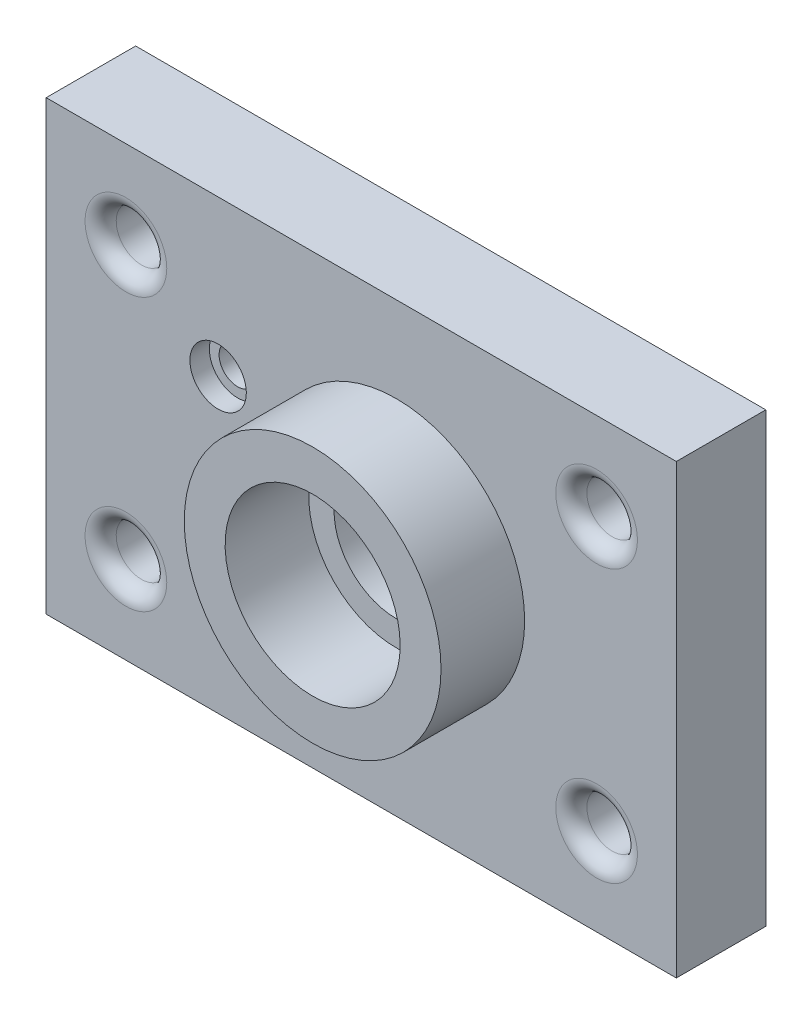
ISO-10303-21;
HEADER;
FILE_DESCRIPTION(('STEP AP214'),'2;1');
FILE_NAME('part.step','',(''),(''),'','','');
FILE_SCHEMA(('AUTOMOTIVE_DESIGN { 1 0 10303 214 1 1 1 1 }'));
ENDSEC;
DATA;
#1=APPLICATION_CONTEXT('core data for automotive mechanical design processes');
#2=APPLICATION_PROTOCOL_DEFINITION('international standard','automotive_design',2000,#1);
#3=PRODUCT_CONTEXT('',#1,'mechanical');
#4=PRODUCT('Part','Part','',(#3));
#5=PRODUCT_RELATED_PRODUCT_CATEGORY('part','',(#4));
#6=PRODUCT_DEFINITION_FORMATION('','',#4);
#7=PRODUCT_DEFINITION_CONTEXT('part definition',#1,'design');
#8=PRODUCT_DEFINITION('design','',#6,#7);
#9=PRODUCT_DEFINITION_SHAPE('','',#8);
#10=(LENGTH_UNIT() NAMED_UNIT(*) SI_UNIT(.MILLI.,.METRE.));
#11=(NAMED_UNIT(*) PLANE_ANGLE_UNIT() SI_UNIT($,.RADIAN.));
#12=(NAMED_UNIT(*) SI_UNIT($,.STERADIAN.) SOLID_ANGLE_UNIT());
#13=UNCERTAINTY_MEASURE_WITH_UNIT(LENGTH_MEASURE(1.E-05),#10,'distance_accuracy_value','');
#14=(GEOMETRIC_REPRESENTATION_CONTEXT(3) GLOBAL_UNCERTAINTY_ASSIGNED_CONTEXT((#13)) GLOBAL_UNIT_ASSIGNED_CONTEXT((#10,
#11,#12)) REPRESENTATION_CONTEXT('',''));
#15=CARTESIAN_POINT('',(0.,0.,0.));
#16=DIRECTION('',(0.,0.,1.));
#17=DIRECTION('',(1.,0.,0.));
#18=AXIS2_PLACEMENT_3D('',#15,#16,#17);
#19=CARTESIAN_POINT('',(44.2,-40.,0.));
#20=DIRECTION('',(0.,0.,1.));
#21=DIRECTION('',(0.,-1.,0.));
#22=AXIS2_PLACEMENT_3D('',#19,#20,#21);
#23=CYLINDRICAL_SURFACE('',#22,4.75);
#24=CARTESIAN_POINT('',(44.2,-40.,0.));
#25=DIRECTION('',(0.,0.,1.));
#26=DIRECTION('',(0.,-1.,0.));
#27=AXIS2_PLACEMENT_3D('',#24,#25,#26);
#28=CIRCLE('',#27,4.75);
#29=CARTESIAN_POINT('',(44.2,-44.75,0.));
#30=VERTEX_POINT('',#29);
#31=EDGE_CURVE('E229',#30,#30,#28,.T.);
#32=ORIENTED_EDGE('',*,*,#31,.F.);
#33=EDGE_LOOP('',(#32));
#34=FACE_BOUND('',#33,.T.);
#35=CARTESIAN_POINT('',(44.2,-40.,18.));
#36=DIRECTION('',(0.,0.,1.));
#37=DIRECTION('',(0.,-1.,0.));
#38=AXIS2_PLACEMENT_3D('',#35,#36,#37);
#39=CIRCLE('',#38,4.75);
#40=CARTESIAN_POINT('',(44.2,-44.75,18.));
#41=VERTEX_POINT('',#40);
#42=EDGE_CURVE('E50',#41,#41,#39,.F.);
#43=ORIENTED_EDGE('',*,*,#42,.F.);
#44=EDGE_LOOP('',(#43));
#45=FACE_BOUND('',#44,.T.);
#46=ADVANCED_FACE('F46',(#34,#45),#23,.F.);
#47=CARTESIAN_POINT('',(0.,0.,23.));
#48=DIRECTION('',(-1.,0.,0.));
#49=DIRECTION('',(0.,0.,1.));
#50=AXIS2_PLACEMENT_3D('',#47,#48,#49);
#51=PLANE('',#50);
#52=DIRECTION('',(0.,1.,0.));
#53=VECTOR('',#52,1.);
#54=CARTESIAN_POINT('',(0.,0.,0.));
#55=LINE('',#54,#53);
#56=CARTESIAN_POINT('',(0.,-115.,0.));
#57=VERTEX_POINT('',#56);
#58=CARTESIAN_POINT('',(0.,0.,0.));
#59=VERTEX_POINT('',#58);
#60=EDGE_CURVE('E116',#57,#59,#55,.T.);
#61=ORIENTED_EDGE('',*,*,#60,.F.);
#62=DIRECTION('',(0.,0.,-1.));
#63=VECTOR('',#62,1.);
#64=CARTESIAN_POINT('',(0.,-115.,23.));
#65=LINE('',#64,#63);
#66=CARTESIAN_POINT('',(0.,-115.,23.));
#67=VERTEX_POINT('',#66);
#68=EDGE_CURVE('E64',#67,#57,#65,.T.);
#69=ORIENTED_EDGE('',*,*,#68,.F.);
#70=DIRECTION('',(0.,1.,0.));
#71=VECTOR('',#70,1.);
#72=CARTESIAN_POINT('',(0.,0.,23.));
#73=LINE('',#72,#71);
#74=CARTESIAN_POINT('',(0.,0.,23.));
#75=VERTEX_POINT('',#74);
#76=EDGE_CURVE('E109',#67,#75,#73,.T.);
#77=ORIENTED_EDGE('',*,*,#76,.T.);
#78=DIRECTION('',(0.,0.,-1.));
#79=VECTOR('',#78,1.);
#80=CARTESIAN_POINT('',(0.,0.,23.));
#81=LINE('',#80,#79);
#82=EDGE_CURVE('E92',#75,#59,#81,.T.);
#83=ORIENTED_EDGE('',*,*,#82,.T.);
#84=EDGE_LOOP('',(#61,#69,#77,#83));
#85=FACE_BOUND('',#84,.T.);
#86=ADVANCED_FACE('F170',(#85),#51,.T.);
#87=CARTESIAN_POINT('',(0.,-115.,23.));
#88=DIRECTION('',(0.,-1.,0.));
#89=DIRECTION('',(0.,0.,-1.));
#90=AXIS2_PLACEMENT_3D('',#87,#88,#89);
#91=PLANE('',#90);
#92=DIRECTION('',(-1.,0.,0.));
#93=VECTOR('',#92,1.);
#94=CARTESIAN_POINT('',(0.,-115.,0.));
#95=LINE('',#94,#93);
#96=CARTESIAN_POINT('',(162.,-115.,0.));
#97=VERTEX_POINT('',#96);
#98=EDGE_CURVE('E111',#97,#57,#95,.T.);
#99=ORIENTED_EDGE('',*,*,#98,.F.);
#100=DIRECTION('',(0.,0.,-1.));
#101=VECTOR('',#100,1.);
#102=CARTESIAN_POINT('',(162.,-115.,23.));
#103=LINE('',#102,#101);
#104=CARTESIAN_POINT('',(162.,-115.,23.));
#105=VERTEX_POINT('',#104);
#106=EDGE_CURVE('E81',#105,#97,#103,.T.);
#107=ORIENTED_EDGE('',*,*,#106,.F.);
#108=DIRECTION('',(-1.,0.,0.));
#109=VECTOR('',#108,1.);
#110=CARTESIAN_POINT('',(0.,-115.,23.));
#111=LINE('',#110,#109);
#112=EDGE_CURVE('E106',#105,#67,#111,.T.);
#113=ORIENTED_EDGE('',*,*,#112,.T.);
#114=ORIENTED_EDGE('',*,*,#68,.T.);
#115=EDGE_LOOP('',(#99,#107,#113,#114));
#116=FACE_BOUND('',#115,.T.);
#117=ADVANCED_FACE('F176',(#116),#91,.T.);
#118=CARTESIAN_POINT('',(162.,0.,23.));
#119=DIRECTION('',(1.,0.,0.));
#120=DIRECTION('',(0.,0.,-1.));
#121=AXIS2_PLACEMENT_3D('',#118,#119,#120);
#122=PLANE('',#121);
#123=DIRECTION('',(0.,-1.,0.));
#124=VECTOR('',#123,1.);
#125=CARTESIAN_POINT('',(162.,0.,0.));
#126=LINE('',#125,#124);
#127=CARTESIAN_POINT('',(162.,0.,0.));
#128=VERTEX_POINT('',#127);
#129=EDGE_CURVE('E100',#128,#97,#126,.T.);
#130=ORIENTED_EDGE('',*,*,#129,.F.);
#131=DIRECTION('',(0.,0.,-1.));
#132=VECTOR('',#131,1.);
#133=CARTESIAN_POINT('',(162.,0.,23.));
#134=LINE('',#133,#132);
#135=CARTESIAN_POINT('',(162.,0.,23.));
#136=VERTEX_POINT('',#135);
#137=EDGE_CURVE('E95',#136,#128,#134,.T.);
#138=ORIENTED_EDGE('',*,*,#137,.F.);
#139=DIRECTION('',(0.,-1.,0.));
#140=VECTOR('',#139,1.);
#141=CARTESIAN_POINT('',(162.,0.,23.));
#142=LINE('',#141,#140);
#143=EDGE_CURVE('E98',#136,#105,#142,.T.);
#144=ORIENTED_EDGE('',*,*,#143,.T.);
#145=ORIENTED_EDGE('',*,*,#106,.T.);
#146=EDGE_LOOP('',(#130,#138,#144,#145));
#147=FACE_BOUND('',#146,.T.);
#148=ADVANCED_FACE('F97',(#147),#122,.T.);
#149=CARTESIAN_POINT('',(0.,0.,23.));
#150=DIRECTION('',(0.,1.,0.));
#151=DIRECTION('',(0.,0.,1.));
#152=AXIS2_PLACEMENT_3D('',#149,#150,#151);
#153=PLANE('',#152);
#154=DIRECTION('',(1.,0.,0.));
#155=VECTOR('',#154,1.);
#156=CARTESIAN_POINT('',(0.,0.,0.));
#157=LINE('',#156,#155);
#158=EDGE_CURVE('E119',#59,#128,#157,.T.);
#159=ORIENTED_EDGE('',*,*,#158,.F.);
#160=ORIENTED_EDGE('',*,*,#82,.F.);
#161=DIRECTION('',(1.,0.,0.));
#162=VECTOR('',#161,1.);
#163=CARTESIAN_POINT('',(0.,0.,23.));
#164=LINE('',#163,#162);
#165=EDGE_CURVE('E105',#75,#136,#164,.T.);
#166=ORIENTED_EDGE('',*,*,#165,.T.);
#167=ORIENTED_EDGE('',*,*,#137,.T.);
#168=EDGE_LOOP('',(#159,#160,#166,#167));
#169=FACE_BOUND('',#168,.T.);
#170=ADVANCED_FACE('F108',(#169),#153,.T.);
#171=CARTESIAN_POINT('',(0.,0.,23.));
#172=DIRECTION('',(0.,0.,1.));
#173=DIRECTION('',(1.,0.,0.));
#174=AXIS2_PLACEMENT_3D('',#171,#172,#173);
#175=PLANE('',#174);
#176=CARTESIAN_POINT('',(44.2,-40.,23.));
#177=DIRECTION('',(0.,0.,1.));
#178=DIRECTION('',(0.,-1.,0.));
#179=AXIS2_PLACEMENT_3D('',#176,#177,#178);
#180=CIRCLE('',#179,7.25);
#181=CARTESIAN_POINT('',(44.2,-47.25,23.));
#182=VERTEX_POINT('',#181);
#183=EDGE_CURVE('E265',#182,#182,#180,.T.);
#184=ORIENTED_EDGE('',*,*,#183,.F.);
#185=EDGE_LOOP('',(#184));
#186=FACE_BOUND('',#185,.T.);
#187=CARTESIAN_POINT('',(141.5,-92.5,23.));
#188=DIRECTION('',(0.,0.,1.));
#189=DIRECTION('',(1.,0.,0.));
#190=AXIS2_PLACEMENT_3D('',#187,#188,#189);
#191=CIRCLE('',#190,10.5);
#192=CARTESIAN_POINT('',(152.,-92.5,23.));
#193=VERTEX_POINT('',#192);
#194=EDGE_CURVE('E146',#193,#193,#191,.F.);
#195=ORIENTED_EDGE('',*,*,#194,.T.);
#196=EDGE_LOOP('',(#195));
#197=FACE_BOUND('',#196,.T.);
#198=CARTESIAN_POINT('',(141.5,-22.5,23.));
#199=DIRECTION('',(0.,0.,1.));
#200=DIRECTION('',(1.,0.,0.));
#201=AXIS2_PLACEMENT_3D('',#198,#199,#200);
#202=CIRCLE('',#201,10.5);
#203=CARTESIAN_POINT('',(152.,-22.5,23.));
#204=VERTEX_POINT('',#203);
#205=EDGE_CURVE('E143',#204,#204,#202,.F.);
#206=ORIENTED_EDGE('',*,*,#205,.T.);
#207=EDGE_LOOP('',(#206));
#208=FACE_BOUND('',#207,.T.);
#209=CARTESIAN_POINT('',(20.5,-22.5,23.));
#210=DIRECTION('',(0.,0.,1.));
#211=DIRECTION('',(1.,0.,0.));
#212=AXIS2_PLACEMENT_3D('',#209,#210,#211);
#213=CIRCLE('',#212,10.5);
#214=CARTESIAN_POINT('',(31.,-22.5,23.));
#215=VERTEX_POINT('',#214);
#216=EDGE_CURVE('E140',#215,#215,#213,.F.);
#217=ORIENTED_EDGE('',*,*,#216,.T.);
#218=EDGE_LOOP('',(#217));
#219=FACE_BOUND('',#218,.T.);
#220=CARTESIAN_POINT('',(20.5,-92.5,23.));
#221=DIRECTION('',(0.,0.,1.));
#222=DIRECTION('',(1.,0.,0.));
#223=AXIS2_PLACEMENT_3D('',#220,#221,#222);
#224=CIRCLE('',#223,10.5);
#225=CARTESIAN_POINT('',(31.,-92.5,23.));
#226=VERTEX_POINT('',#225);
#227=EDGE_CURVE('E134',#226,#226,#224,.F.);
#228=ORIENTED_EDGE('',*,*,#227,.T.);
#229=EDGE_LOOP('',(#228));
#230=FACE_BOUND('',#229,.T.);
#231=CARTESIAN_POINT('',(90.,-55.,23.));
#232=DIRECTION('',(0.,0.,1.));
#233=DIRECTION('',(0.,-1.,0.));
#234=AXIS2_PLACEMENT_3D('',#231,#232,#233);
#235=CIRCLE('',#234,33.);
#236=CARTESIAN_POINT('',(90.,-88.,23.));
#237=VERTEX_POINT('',#236);
#238=EDGE_CURVE('E242',#237,#237,#235,.T.);
#239=ORIENTED_EDGE('',*,*,#238,.F.);
#240=EDGE_LOOP('',(#239));
#241=FACE_BOUND('',#240,.T.);
#242=ORIENTED_EDGE('',*,*,#76,.F.);
#243=ORIENTED_EDGE('',*,*,#112,.F.);
#244=ORIENTED_EDGE('',*,*,#143,.F.);
#245=ORIENTED_EDGE('',*,*,#165,.F.);
#246=EDGE_LOOP('',(#242,#243,#244,#245));
#247=FACE_BOUND('',#246,.T.);
#248=ADVANCED_FACE('F104',(#186,#197,#208,#219,#230,#241,#247),#175,.T.);
#249=CARTESIAN_POINT('',(0.,0.,0.));
#250=DIRECTION('',(0.,0.,1.));
#251=DIRECTION('',(1.,0.,0.));
#252=AXIS2_PLACEMENT_3D('',#249,#250,#251);
#253=PLANE('',#252);
#254=CARTESIAN_POINT('',(90.,-55.,0.));
#255=DIRECTION('',(0.,0.,1.));
#256=DIRECTION('',(0.,-1.,0.));
#257=AXIS2_PLACEMENT_3D('',#254,#255,#256);
#258=CIRCLE('',#257,16.);
#259=CARTESIAN_POINT('',(90.,-71.,0.));
#260=VERTEX_POINT('',#259);
#261=EDGE_CURVE('E262',#260,#260,#258,.T.);
#262=ORIENTED_EDGE('',*,*,#261,.T.);
#263=EDGE_LOOP('',(#262));
#264=FACE_BOUND('',#263,.T.);
#265=CARTESIAN_POINT('',(141.5,-92.5,0.));
#266=DIRECTION('',(0.,0.,1.));
#267=DIRECTION('',(0.,-1.,0.));
#268=AXIS2_PLACEMENT_3D('',#265,#266,#267);
#269=CIRCLE('',#268,6.50000000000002);
#270=CARTESIAN_POINT('',(141.5,-99.,0.));
#271=VERTEX_POINT('',#270);
#272=EDGE_CURVE('E273',#271,#271,#269,.T.);
#273=ORIENTED_EDGE('',*,*,#272,.T.);
#274=EDGE_LOOP('',(#273));
#275=FACE_BOUND('',#274,.T.);
#276=CARTESIAN_POINT('',(141.5,-22.5,0.));
#277=DIRECTION('',(0.,0.,1.));
#278=DIRECTION('',(0.,-1.,0.));
#279=AXIS2_PLACEMENT_3D('',#276,#277,#278);
#280=CIRCLE('',#279,6.50000000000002);
#281=CARTESIAN_POINT('',(141.5,-29.,0.));
#282=VERTEX_POINT('',#281);
#283=EDGE_CURVE('E236',#282,#282,#280,.T.);
#284=ORIENTED_EDGE('',*,*,#283,.T.);
#285=EDGE_LOOP('',(#284));
#286=FACE_BOUND('',#285,.T.);
#287=CARTESIAN_POINT('',(20.5,-22.5,0.));
#288=DIRECTION('',(0.,0.,1.));
#289=DIRECTION('',(0.,-1.,0.));
#290=AXIS2_PLACEMENT_3D('',#287,#288,#289);
#291=CIRCLE('',#290,6.50000000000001);
#292=CARTESIAN_POINT('',(20.5,-29.,0.));
#293=VERTEX_POINT('',#292);
#294=EDGE_CURVE('E230',#293,#293,#291,.T.);
#295=ORIENTED_EDGE('',*,*,#294,.T.);
#296=EDGE_LOOP('',(#295));
#297=FACE_BOUND('',#296,.T.);
#298=CARTESIAN_POINT('',(20.5,-92.5,0.));
#299=DIRECTION('',(0.,0.,1.));
#300=DIRECTION('',(0.,-1.,0.));
#301=AXIS2_PLACEMENT_3D('',#298,#299,#300);
#302=CIRCLE('',#301,6.50000000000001);
#303=CARTESIAN_POINT('',(20.5,-99.,0.));
#304=VERTEX_POINT('',#303);
#305=EDGE_CURVE('E227',#304,#304,#302,.T.);
#306=ORIENTED_EDGE('',*,*,#305,.T.);
#307=EDGE_LOOP('',(#306));
#308=FACE_BOUND('',#307,.T.);
#309=ORIENTED_EDGE('',*,*,#31,.T.);
#310=EDGE_LOOP('',(#309));
#311=FACE_BOUND('',#310,.T.);
#312=ORIENTED_EDGE('',*,*,#60,.T.);
#313=ORIENTED_EDGE('',*,*,#158,.T.);
#314=ORIENTED_EDGE('',*,*,#129,.T.);
#315=ORIENTED_EDGE('',*,*,#98,.T.);
#316=EDGE_LOOP('',(#312,#313,#314,#315));
#317=FACE_BOUND('',#316,.T.);
#318=ADVANCED_FACE('F193',(#264,#275,#286,#297,#308,#311,#317),#253,.F.);
#319=CARTESIAN_POINT('',(90.,-55.,44.5));
#320=DIRECTION('',(0.,0.,1.));
#321=DIRECTION('',(0.,-1.,0.));
#322=AXIS2_PLACEMENT_3D('',#319,#320,#321);
#323=PLANE('',#322);
#324=CARTESIAN_POINT('',(90.,-55.,44.5));
#325=DIRECTION('',(0.,0.,1.));
#326=DIRECTION('',(0.,-1.,0.));
#327=AXIS2_PLACEMENT_3D('',#324,#325,#326);
#328=CIRCLE('',#327,33.);
#329=CARTESIAN_POINT('',(90.,-88.,44.5));
#330=VERTEX_POINT('',#329);
#331=EDGE_CURVE('E120',#330,#330,#328,.T.);
#332=ORIENTED_EDGE('',*,*,#331,.T.);
#333=EDGE_LOOP('',(#332));
#334=FACE_BOUND('',#333,.T.);
#335=CARTESIAN_POINT('',(90.,-55.,44.5));
#336=DIRECTION('',(0.,0.,1.));
#337=DIRECTION('',(0.,-1.,0.));
#338=AXIS2_PLACEMENT_3D('',#335,#336,#337);
#339=CIRCLE('',#338,22.5);
#340=CARTESIAN_POINT('',(90.,-77.5,44.5));
#341=VERTEX_POINT('',#340);
#342=EDGE_CURVE('E233',#341,#341,#339,.T.);
#343=ORIENTED_EDGE('',*,*,#342,.F.);
#344=EDGE_LOOP('',(#343));
#345=FACE_BOUND('',#344,.T.);
#346=ADVANCED_FACE('F190',(#334,#345),#323,.T.);
#347=CARTESIAN_POINT('',(90.,-55.,44.5));
#348=DIRECTION('',(0.,0.,-1.));
#349=DIRECTION('',(0.,1.,0.));
#350=AXIS2_PLACEMENT_3D('',#347,#348,#349);
#351=CYLINDRICAL_SURFACE('',#350,33.);
#352=ORIENTED_EDGE('',*,*,#331,.F.);
#353=EDGE_LOOP('',(#352));
#354=FACE_BOUND('',#353,.T.);
#355=ORIENTED_EDGE('',*,*,#238,.T.);
#356=EDGE_LOOP('',(#355));
#357=FACE_BOUND('',#356,.T.);
#358=ADVANCED_FACE('F188',(#354,#357),#351,.T.);
#359=CARTESIAN_POINT('',(90.,-55.,44.5));
#360=DIRECTION('',(0.,0.,-1.));
#361=DIRECTION('',(0.,1.,0.));
#362=AXIS2_PLACEMENT_3D('',#359,#360,#361);
#363=CYLINDRICAL_SURFACE('',#362,22.5);
#364=ORIENTED_EDGE('',*,*,#342,.T.);
#365=EDGE_LOOP('',(#364));
#366=FACE_BOUND('',#365,.T.);
#367=CARTESIAN_POINT('',(90.,-55.,23.));
#368=DIRECTION('',(0.,0.,1.));
#369=DIRECTION('',(1.,0.,0.));
#370=AXIS2_PLACEMENT_3D('',#367,#368,#369);
#371=CIRCLE('',#370,22.5);
#372=CARTESIAN_POINT('',(112.5,-55.,23.));
#373=VERTEX_POINT('',#372);
#374=EDGE_CURVE('E126',#373,#373,#371,.F.);
#375=ORIENTED_EDGE('',*,*,#374,.T.);
#376=EDGE_LOOP('',(#375));
#377=FACE_BOUND('',#376,.T.);
#378=ADVANCED_FACE('F184',(#366,#377),#363,.F.);
#379=CARTESIAN_POINT('',(90.,-55.,23.));
#380=DIRECTION('',(0.,0.,1.));
#381=DIRECTION('',(0.,-1.,0.));
#382=AXIS2_PLACEMENT_3D('',#379,#380,#381);
#383=CIRCLE('',#382,16.);
#384=CARTESIAN_POINT('',(90.,-71.,23.));
#385=VERTEX_POINT('',#384);
#386=EDGE_CURVE('E260',#385,#385,#383,.T.);
#387=ORIENTED_EDGE('',*,*,#386,.F.);
#388=EDGE_LOOP('',(#387));
#389=FACE_BOUND('',#388,.T.);
#390=ORIENTED_EDGE('',*,*,#374,.F.);
#391=EDGE_LOOP('',(#390));
#392=FACE_BOUND('',#391,.T.);
#393=ADVANCED_FACE('F187',(#389,#392),#175,.T.);
#394=CARTESIAN_POINT('',(20.5,-92.5,0.));
#395=DIRECTION('',(0.,0.,1.));
#396=DIRECTION('',(0.,-1.,0.));
#397=AXIS2_PLACEMENT_3D('',#394,#395,#396);
#398=CYLINDRICAL_SURFACE('',#397,6.50000000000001);
#399=CARTESIAN_POINT('',(20.5,-92.5,19.));
#400=DIRECTION('',(0.,0.,1.));
#401=DIRECTION('',(1.,0.,0.));
#402=AXIS2_PLACEMENT_3D('',#399,#400,#401);
#403=CIRCLE('',#402,6.50000000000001);
#404=CARTESIAN_POINT('',(27.,-92.5,19.));
#405=VERTEX_POINT('',#404);
#406=EDGE_CURVE('E131',#405,#405,#403,.T.);
#407=ORIENTED_EDGE('',*,*,#406,.T.);
#408=EDGE_LOOP('',(#407));
#409=FACE_BOUND('',#408,.T.);
#410=ORIENTED_EDGE('',*,*,#305,.F.);
#411=EDGE_LOOP('',(#410));
#412=FACE_BOUND('',#411,.T.);
#413=ADVANCED_FACE('F182',(#409,#412),#398,.F.);
#414=CARTESIAN_POINT('',(20.5,-22.5,0.));
#415=DIRECTION('',(0.,0.,1.));
#416=DIRECTION('',(0.,-1.,0.));
#417=AXIS2_PLACEMENT_3D('',#414,#415,#416);
#418=CYLINDRICAL_SURFACE('',#417,6.50000000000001);
#419=CARTESIAN_POINT('',(20.5,-22.5,19.));
#420=DIRECTION('',(0.,0.,1.));
#421=DIRECTION('',(1.,0.,0.));
#422=AXIS2_PLACEMENT_3D('',#419,#420,#421);
#423=CIRCLE('',#422,6.50000000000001);
#424=CARTESIAN_POINT('',(27.,-22.5,19.));
#425=VERTEX_POINT('',#424);
#426=EDGE_CURVE('E13',#425,#425,#423,.T.);
#427=ORIENTED_EDGE('',*,*,#426,.T.);
#428=EDGE_LOOP('',(#427));
#429=FACE_BOUND('',#428,.T.);
#430=ORIENTED_EDGE('',*,*,#294,.F.);
#431=EDGE_LOOP('',(#430));
#432=FACE_BOUND('',#431,.T.);
#433=ADVANCED_FACE('F224',(#429,#432),#418,.F.);
#434=CARTESIAN_POINT('',(141.5,-22.5,0.));
#435=DIRECTION('',(0.,0.,1.));
#436=DIRECTION('',(0.,-1.,0.));
#437=AXIS2_PLACEMENT_3D('',#434,#435,#436);
#438=CYLINDRICAL_SURFACE('',#437,6.50000000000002);
#439=CARTESIAN_POINT('',(141.5,-22.5,19.));
#440=DIRECTION('',(0.,0.,1.));
#441=DIRECTION('',(1.,0.,0.));
#442=AXIS2_PLACEMENT_3D('',#439,#440,#441);
#443=CIRCLE('',#442,6.50000000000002);
#444=CARTESIAN_POINT('',(148.,-22.5,19.));
#445=VERTEX_POINT('',#444);
#446=EDGE_CURVE('E56',#445,#445,#443,.T.);
#447=ORIENTED_EDGE('',*,*,#446,.T.);
#448=EDGE_LOOP('',(#447));
#449=FACE_BOUND('',#448,.T.);
#450=ORIENTED_EDGE('',*,*,#283,.F.);
#451=EDGE_LOOP('',(#450));
#452=FACE_BOUND('',#451,.T.);
#453=ADVANCED_FACE('F152',(#449,#452),#438,.F.);
#454=CARTESIAN_POINT('',(141.5,-92.5,0.));
#455=DIRECTION('',(0.,0.,1.));
#456=DIRECTION('',(0.,-1.,0.));
#457=AXIS2_PLACEMENT_3D('',#454,#455,#456);
#458=CYLINDRICAL_SURFACE('',#457,6.50000000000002);
#459=CARTESIAN_POINT('',(141.5,-92.5,19.));
#460=DIRECTION('',(0.,0.,1.));
#461=DIRECTION('',(1.,0.,0.));
#462=AXIS2_PLACEMENT_3D('',#459,#460,#461);
#463=CIRCLE('',#462,6.50000000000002);
#464=CARTESIAN_POINT('',(148.,-92.5,19.));
#465=VERTEX_POINT('',#464);
#466=EDGE_CURVE('E137',#465,#465,#463,.T.);
#467=ORIENTED_EDGE('',*,*,#466,.T.);
#468=EDGE_LOOP('',(#467));
#469=FACE_BOUND('',#468,.T.);
#470=ORIENTED_EDGE('',*,*,#272,.F.);
#471=EDGE_LOOP('',(#470));
#472=FACE_BOUND('',#471,.T.);
#473=ADVANCED_FACE('F211',(#469,#472),#458,.F.);
#474=CARTESIAN_POINT('',(20.5,-92.5,19.));
#475=DIRECTION('',(0.,0.,1.));
#476=DIRECTION('',(1.,0.,0.));
#477=AXIS2_PLACEMENT_3D('',#474,#475,#476);
#478=TOROIDAL_SURFACE('',#477,10.5,4.);
#479=ORIENTED_EDGE('',*,*,#227,.F.);
#480=EDGE_LOOP('',(#479));
#481=FACE_BOUND('',#480,.T.);
#482=ORIENTED_EDGE('',*,*,#406,.F.);
#483=EDGE_LOOP('',(#482));
#484=FACE_BOUND('',#483,.T.);
#485=ADVANCED_FACE('F165',(#481,#484),#478,.T.);
#486=CARTESIAN_POINT('',(141.5,-92.5,19.));
#487=DIRECTION('',(0.,0.,1.));
#488=DIRECTION('',(1.,0.,0.));
#489=AXIS2_PLACEMENT_3D('',#486,#487,#488);
#490=TOROIDAL_SURFACE('',#489,10.5,4.);
#491=ORIENTED_EDGE('',*,*,#194,.F.);
#492=EDGE_LOOP('',(#491));
#493=FACE_BOUND('',#492,.T.);
#494=ORIENTED_EDGE('',*,*,#466,.F.);
#495=EDGE_LOOP('',(#494));
#496=FACE_BOUND('',#495,.T.);
#497=ADVANCED_FACE('F157',(#493,#496),#490,.T.);
#498=CARTESIAN_POINT('',(141.5,-22.5,19.));
#499=DIRECTION('',(0.,0.,1.));
#500=DIRECTION('',(1.,0.,0.));
#501=AXIS2_PLACEMENT_3D('',#498,#499,#500);
#502=TOROIDAL_SURFACE('',#501,10.5,4.);
#503=ORIENTED_EDGE('',*,*,#205,.F.);
#504=EDGE_LOOP('',(#503));
#505=FACE_BOUND('',#504,.T.);
#506=ORIENTED_EDGE('',*,*,#446,.F.);
#507=EDGE_LOOP('',(#506));
#508=FACE_BOUND('',#507,.T.);
#509=ADVANCED_FACE('F155',(#505,#508),#502,.T.);
#510=CARTESIAN_POINT('',(20.5,-22.5,19.));
#511=DIRECTION('',(0.,0.,1.));
#512=DIRECTION('',(1.,0.,0.));
#513=AXIS2_PLACEMENT_3D('',#510,#511,#512);
#514=TOROIDAL_SURFACE('',#513,10.5,4.);
#515=ORIENTED_EDGE('',*,*,#216,.F.);
#516=EDGE_LOOP('',(#515));
#517=FACE_BOUND('',#516,.T.);
#518=ORIENTED_EDGE('',*,*,#426,.F.);
#519=EDGE_LOOP('',(#518));
#520=FACE_BOUND('',#519,.T.);
#521=ADVANCED_FACE('F48',(#517,#520),#514,.T.);
#522=CARTESIAN_POINT('',(44.2,-40.,18.));
#523=DIRECTION('',(0.,0.,1.));
#524=DIRECTION('',(0.,-1.,0.));
#525=AXIS2_PLACEMENT_3D('',#522,#523,#524);
#526=PLANE('',#525);
#527=CARTESIAN_POINT('',(44.2,-40.,18.));
#528=DIRECTION('',(0.,0.,1.));
#529=DIRECTION('',(0.,-1.,0.));
#530=AXIS2_PLACEMENT_3D('',#527,#528,#529);
#531=CIRCLE('',#530,7.25);
#532=CARTESIAN_POINT('',(44.2,-47.25,18.));
#533=VERTEX_POINT('',#532);
#534=EDGE_CURVE('E268',#533,#533,#531,.T.);
#535=ORIENTED_EDGE('',*,*,#534,.T.);
#536=EDGE_LOOP('',(#535));
#537=FACE_BOUND('',#536,.T.);
#538=ORIENTED_EDGE('',*,*,#42,.T.);
#539=EDGE_LOOP('',(#538));
#540=FACE_BOUND('',#539,.T.);
#541=ADVANCED_FACE('F163',(#537,#540),#526,.T.);
#542=CARTESIAN_POINT('',(44.2,-40.,18.));
#543=DIRECTION('',(0.,0.,1.));
#544=DIRECTION('',(0.,-1.,0.));
#545=AXIS2_PLACEMENT_3D('',#542,#543,#544);
#546=CYLINDRICAL_SURFACE('',#545,7.25);
#547=ORIENTED_EDGE('',*,*,#534,.F.);
#548=EDGE_LOOP('',(#547));
#549=FACE_BOUND('',#548,.T.);
#550=ORIENTED_EDGE('',*,*,#183,.T.);
#551=EDGE_LOOP('',(#550));
#552=FACE_BOUND('',#551,.T.);
#553=ADVANCED_FACE('F286',(#549,#552),#546,.F.);
#554=CARTESIAN_POINT('',(90.,-55.,0.));
#555=DIRECTION('',(0.,0.,1.));
#556=DIRECTION('',(0.,-1.,0.));
#557=AXIS2_PLACEMENT_3D('',#554,#555,#556);
#558=CYLINDRICAL_SURFACE('',#557,16.);
#559=ORIENTED_EDGE('',*,*,#261,.F.);
#560=EDGE_LOOP('',(#559));
#561=FACE_BOUND('',#560,.T.);
#562=ORIENTED_EDGE('',*,*,#386,.T.);
#563=EDGE_LOOP('',(#562));
#564=FACE_BOUND('',#563,.T.);
#565=ADVANCED_FACE('F289',(#561,#564),#558,.F.);
#566=CLOSED_SHELL('',(#46,#86,#117,#148,#170,#248,#318,#346,#358,#378,#393,#413,#433,#453,#473,
#485,#497,#509,#521,#541,#553,#565));
#567=MANIFOLD_SOLID_BREP('B2',#566);
#568=ADVANCED_BREP_SHAPE_REPRESENTATION('',(#18,#567),#14);
#569=SHAPE_DEFINITION_REPRESENTATION(#9,#568);
ENDSEC;
END-ISO-10303-21;
